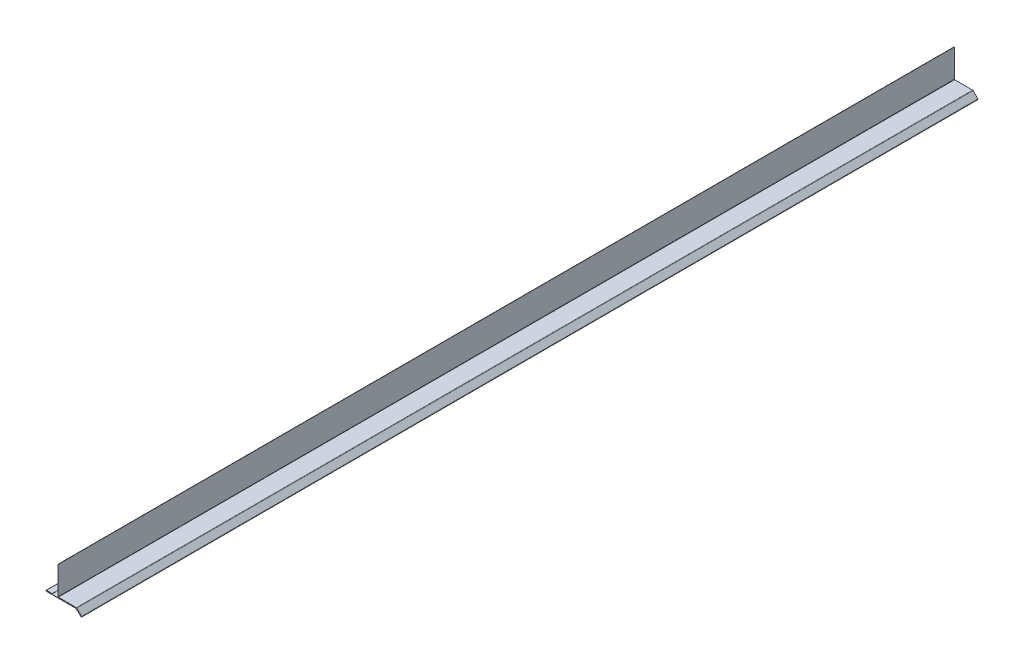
from build123d import *

# Parameters (mm, degrees)
EXTRUDE_THIN1_DEPTH = 2000


with BuildPart() as part:
    # Sketch1 → Extrude-Thin1 (new body)
    with BuildSketch(Plane.XY):
        with BuildLine():
            Line((-12.7, 0), (-25.4, 0))
            ThreePointArc((-25.4, 0), (-25.908, -0.508), (-25.4, -1.016))
            Line((-25.4, -1.016), (41.06457951, -1.016))
            ThreePointArc((41.06457951, -1.016), (41.258982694, -1.054669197), (41.423789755, -1.164789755))
            Line((41.423789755, -1.164789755), (51.930689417, -11.671689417))
            ThreePointArc((51.930689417, -11.671689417), (52.649109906, -11.671689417), (52.649109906, -10.953268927))
            Line((52.649109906, -10.953268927), (41.99342049, -0.29757951))
            ThreePointArc((41.99342049, -0.29757951), (41.663806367, -0.077338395), (41.275, 0))
            Line((41.275, 0), (1, 0))
            ThreePointArc((1, 0), (0.292893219, 0.292893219), (0, 1))
            Line((0, 1), (0, 63.5))
            Line((0, 63.5), (0.508, 63.5))
            Line((0.508, 63.5), (0.508, 1))
            ThreePointArc((0.508, 1), (0.652103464, 0.652103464), (1, 0.508))
            Line((1, 0.508), (41.275, 0.508))
            ThreePointArc((41.275, 0.508), (41.858209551, 0.391992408), (42.352630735, 0.061630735))
            Line((42.352630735, 0.061630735), (53.008320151, -10.594058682))
            ThreePointArc((53.008320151, -10.594058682), (53.008320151, -12.030899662), (51.571479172, -12.030899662))
            Line((51.571479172, -12.030899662), (41.06457951, -1.524))
            Line((41.06457951, -1.524), (-25.4, -1.524))
            ThreePointArc((-25.4, -1.524), (-26.416, -0.508), (-25.4, 0.508))
            Line((-25.4, 0.508), (-12.7, 0.508))
            Line((-12.7, 0.508), (-12.7, 0))
        make_face()
    extrude(amount=EXTRUDE_THIN1_DEPTH)


solid = part.part
